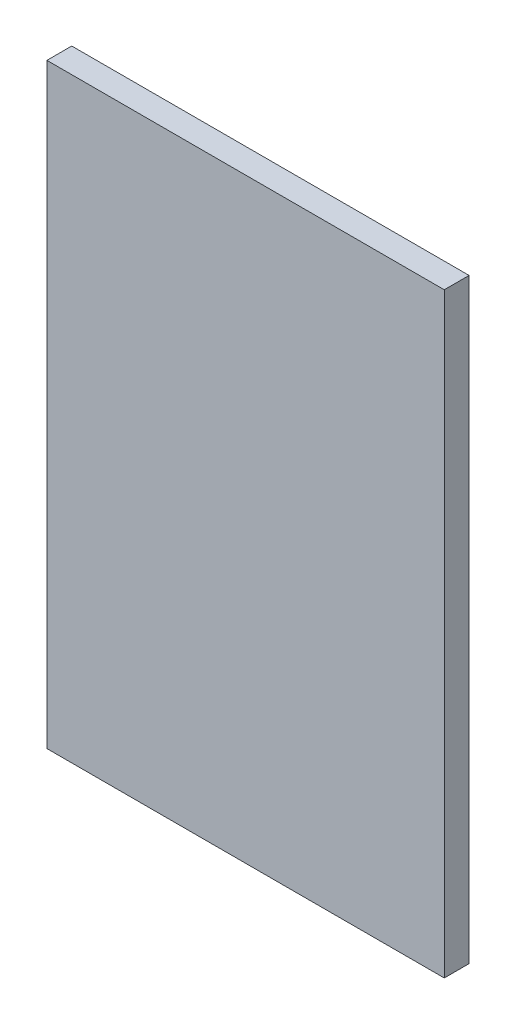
ISO-10303-21;
HEADER;
FILE_DESCRIPTION(('STEP AP214'),'2;1');
FILE_NAME('part.step','',(''),(''),'','','');
FILE_SCHEMA(('AUTOMOTIVE_DESIGN { 1 0 10303 214 1 1 1 1 }'));
ENDSEC;
DATA;
#1=APPLICATION_CONTEXT('core data for automotive mechanical design processes');
#2=APPLICATION_PROTOCOL_DEFINITION('international standard','automotive_design',2000,#1);
#3=PRODUCT_CONTEXT('',#1,'mechanical');
#4=PRODUCT('Part','Part','',(#3));
#5=PRODUCT_RELATED_PRODUCT_CATEGORY('part','',(#4));
#6=PRODUCT_DEFINITION_FORMATION('','',#4);
#7=PRODUCT_DEFINITION_CONTEXT('part definition',#1,'design');
#8=PRODUCT_DEFINITION('design','',#6,#7);
#9=PRODUCT_DEFINITION_SHAPE('','',#8);
#10=(LENGTH_UNIT() NAMED_UNIT(*) SI_UNIT(.MILLI.,.METRE.));
#11=(NAMED_UNIT(*) PLANE_ANGLE_UNIT() SI_UNIT($,.RADIAN.));
#12=(NAMED_UNIT(*) SI_UNIT($,.STERADIAN.) SOLID_ANGLE_UNIT());
#13=UNCERTAINTY_MEASURE_WITH_UNIT(LENGTH_MEASURE(1.E-05),#10,'distance_accuracy_value','');
#14=(GEOMETRIC_REPRESENTATION_CONTEXT(3) GLOBAL_UNCERTAINTY_ASSIGNED_CONTEXT((#13)) GLOBAL_UNIT_ASSIGNED_CONTEXT((#10,
#11,#12)) REPRESENTATION_CONTEXT('',''));
#15=CARTESIAN_POINT('',(0.,0.,0.));
#16=DIRECTION('',(0.,0.,1.));
#17=DIRECTION('',(1.,0.,0.));
#18=AXIS2_PLACEMENT_3D('',#15,#16,#17);
#19=CARTESIAN_POINT('',(0.,0.,19.05));
#20=DIRECTION('',(1.,0.,0.));
#21=DIRECTION('',(0.,0.,-1.));
#22=AXIS2_PLACEMENT_3D('',#19,#20,#21);
#23=PLANE('',#22);
#24=DIRECTION('',(0.,-1.,0.));
#25=VECTOR('',#24,1.);
#26=CARTESIAN_POINT('',(0.,0.,0.));
#27=LINE('',#26,#25);
#28=CARTESIAN_POINT('',(0.,457.2,0.));
#29=VERTEX_POINT('',#28);
#30=CARTESIAN_POINT('',(0.,0.,0.));
#31=VERTEX_POINT('',#30);
#32=EDGE_CURVE('E95',#29,#31,#27,.T.);
#33=ORIENTED_EDGE('',*,*,#32,.T.);
#34=DIRECTION('',(0.,0.,-1.));
#35=VECTOR('',#34,1.);
#36=CARTESIAN_POINT('',(0.,0.,19.05));
#37=LINE('',#36,#35);
#38=CARTESIAN_POINT('',(0.,0.,19.05));
#39=VERTEX_POINT('',#38);
#40=EDGE_CURVE('E11',#39,#31,#37,.T.);
#41=ORIENTED_EDGE('',*,*,#40,.F.);
#42=DIRECTION('',(0.,-1.,0.));
#43=VECTOR('',#42,1.);
#44=CARTESIAN_POINT('',(0.,0.,19.05));
#45=LINE('',#44,#43);
#46=CARTESIAN_POINT('',(0.,457.2,19.05));
#47=VERTEX_POINT('',#46);
#48=EDGE_CURVE('E83',#47,#39,#45,.T.);
#49=ORIENTED_EDGE('',*,*,#48,.F.);
#50=DIRECTION('',(0.,0.,-1.));
#51=VECTOR('',#50,1.);
#52=CARTESIAN_POINT('',(0.,457.2,19.05));
#53=LINE('',#52,#51);
#54=EDGE_CURVE('E91',#47,#29,#53,.T.);
#55=ORIENTED_EDGE('',*,*,#54,.T.);
#56=EDGE_LOOP('',(#33,#41,#49,#55));
#57=FACE_BOUND('',#56,.T.);
#58=ADVANCED_FACE('F32',(#57),#23,.F.);
#59=CARTESIAN_POINT('',(0.,0.,19.05));
#60=DIRECTION('',(0.,1.,0.));
#61=DIRECTION('',(0.,0.,1.));
#62=AXIS2_PLACEMENT_3D('',#59,#60,#61);
#63=PLANE('',#62);
#64=DIRECTION('',(1.,0.,0.));
#65=VECTOR('',#64,1.);
#66=CARTESIAN_POINT('',(0.,0.,0.));
#67=LINE('',#66,#65);
#68=CARTESIAN_POINT('',(304.8,0.,0.));
#69=VERTEX_POINT('',#68);
#70=EDGE_CURVE('E87',#31,#69,#67,.T.);
#71=ORIENTED_EDGE('',*,*,#70,.T.);
#72=DIRECTION('',(0.,0.,-1.));
#73=VECTOR('',#72,1.);
#74=CARTESIAN_POINT('',(304.8,0.,19.05));
#75=LINE('',#74,#73);
#76=CARTESIAN_POINT('',(304.8,0.,19.05));
#77=VERTEX_POINT('',#76);
#78=EDGE_CURVE('E40',#77,#69,#75,.T.);
#79=ORIENTED_EDGE('',*,*,#78,.F.);
#80=DIRECTION('',(1.,0.,0.));
#81=VECTOR('',#80,1.);
#82=CARTESIAN_POINT('',(0.,0.,19.05));
#83=LINE('',#82,#81);
#84=EDGE_CURVE('E78',#39,#77,#83,.T.);
#85=ORIENTED_EDGE('',*,*,#84,.F.);
#86=ORIENTED_EDGE('',*,*,#40,.T.);
#87=EDGE_LOOP('',(#71,#79,#85,#86));
#88=FACE_BOUND('',#87,.T.);
#89=ADVANCED_FACE('F86',(#88),#63,.F.);
#90=CARTESIAN_POINT('',(304.8,0.,19.05));
#91=DIRECTION('',(-1.,0.,0.));
#92=DIRECTION('',(0.,0.,1.));
#93=AXIS2_PLACEMENT_3D('',#90,#91,#92);
#94=PLANE('',#93);
#95=DIRECTION('',(0.,1.,0.));
#96=VECTOR('',#95,1.);
#97=CARTESIAN_POINT('',(304.8,0.,0.));
#98=LINE('',#97,#96);
#99=CARTESIAN_POINT('',(304.8,457.2,0.));
#100=VERTEX_POINT('',#99);
#101=EDGE_CURVE('E65',#69,#100,#98,.T.);
#102=ORIENTED_EDGE('',*,*,#101,.T.);
#103=DIRECTION('',(0.,0.,-1.));
#104=VECTOR('',#103,1.);
#105=CARTESIAN_POINT('',(304.8,457.2,19.05));
#106=LINE('',#105,#104);
#107=CARTESIAN_POINT('',(304.8,457.2,19.05));
#108=VERTEX_POINT('',#107);
#109=EDGE_CURVE('E88',#108,#100,#106,.T.);
#110=ORIENTED_EDGE('',*,*,#109,.F.);
#111=DIRECTION('',(0.,1.,0.));
#112=VECTOR('',#111,1.);
#113=CARTESIAN_POINT('',(304.8,0.,19.05));
#114=LINE('',#113,#112);
#115=EDGE_CURVE('E81',#77,#108,#114,.T.);
#116=ORIENTED_EDGE('',*,*,#115,.F.);
#117=ORIENTED_EDGE('',*,*,#78,.T.);
#118=EDGE_LOOP('',(#102,#110,#116,#117));
#119=FACE_BOUND('',#118,.T.);
#120=ADVANCED_FACE('F89',(#119),#94,.F.);
#121=CARTESIAN_POINT('',(0.,457.2,19.05));
#122=DIRECTION('',(0.,-1.,0.));
#123=DIRECTION('',(0.,0.,-1.));
#124=AXIS2_PLACEMENT_3D('',#121,#122,#123);
#125=PLANE('',#124);
#126=DIRECTION('',(-1.,0.,0.));
#127=VECTOR('',#126,1.);
#128=CARTESIAN_POINT('',(0.,457.2,0.));
#129=LINE('',#128,#127);
#130=EDGE_CURVE('E71',#100,#29,#129,.T.);
#131=ORIENTED_EDGE('',*,*,#130,.T.);
#132=ORIENTED_EDGE('',*,*,#54,.F.);
#133=DIRECTION('',(-1.,0.,0.));
#134=VECTOR('',#133,1.);
#135=CARTESIAN_POINT('',(0.,457.2,19.05));
#136=LINE('',#135,#134);
#137=EDGE_CURVE('E48',#108,#47,#136,.T.);
#138=ORIENTED_EDGE('',*,*,#137,.F.);
#139=ORIENTED_EDGE('',*,*,#109,.T.);
#140=EDGE_LOOP('',(#131,#132,#138,#139));
#141=FACE_BOUND('',#140,.T.);
#142=ADVANCED_FACE('F102',(#141),#125,.F.);
#143=CARTESIAN_POINT('',(0.,457.2,19.05));
#144=DIRECTION('',(0.,0.,-1.));
#145=DIRECTION('',(-1.,0.,0.));
#146=AXIS2_PLACEMENT_3D('',#143,#144,#145);
#147=PLANE('',#146);
#148=ORIENTED_EDGE('',*,*,#48,.T.);
#149=ORIENTED_EDGE('',*,*,#84,.T.);
#150=ORIENTED_EDGE('',*,*,#115,.T.);
#151=ORIENTED_EDGE('',*,*,#137,.T.);
#152=EDGE_LOOP('',(#148,#149,#150,#151));
#153=FACE_BOUND('',#152,.T.);
#154=ADVANCED_FACE('F79',(#153),#147,.F.);
#155=CARTESIAN_POINT('',(0.,457.2,0.));
#156=DIRECTION('',(0.,0.,-1.));
#157=DIRECTION('',(-1.,0.,0.));
#158=AXIS2_PLACEMENT_3D('',#155,#156,#157);
#159=PLANE('',#158);
#160=ORIENTED_EDGE('',*,*,#32,.F.);
#161=ORIENTED_EDGE('',*,*,#130,.F.);
#162=ORIENTED_EDGE('',*,*,#101,.F.);
#163=ORIENTED_EDGE('',*,*,#70,.F.);
#164=EDGE_LOOP('',(#160,#161,#162,#163));
#165=FACE_BOUND('',#164,.T.);
#166=ADVANCED_FACE('F105',(#165),#159,.T.);
#167=CLOSED_SHELL('',(#58,#89,#120,#142,#154,#166));
#168=MANIFOLD_SOLID_BREP('B2',#167);
#169=ADVANCED_BREP_SHAPE_REPRESENTATION('',(#18,#168),#14);
#170=SHAPE_DEFINITION_REPRESENTATION(#9,#169);
ENDSEC;
END-ISO-10303-21;
